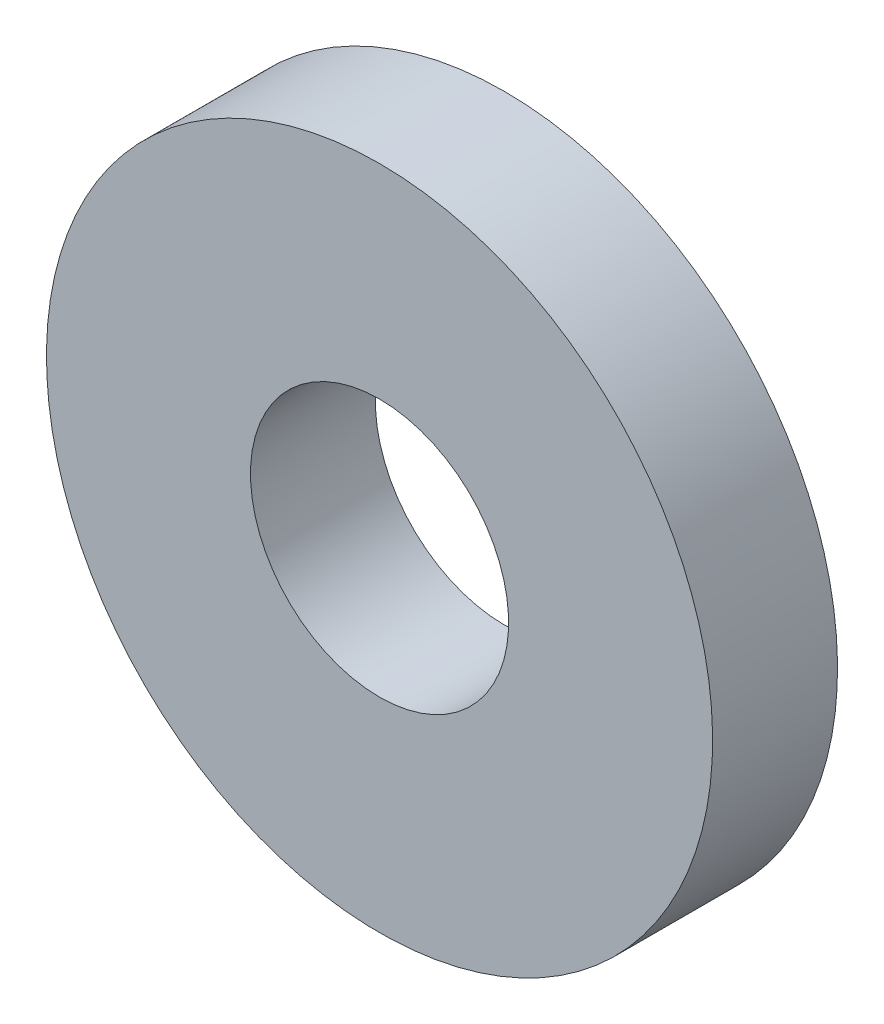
ISO-10303-21;
HEADER;
FILE_DESCRIPTION(('STEP AP214'),'2;1');
FILE_NAME('part.step','',(''),(''),'','','');
FILE_SCHEMA(('AUTOMOTIVE_DESIGN { 1 0 10303 214 1 1 1 1 }'));
ENDSEC;
DATA;
#1=APPLICATION_CONTEXT('core data for automotive mechanical design processes');
#2=APPLICATION_PROTOCOL_DEFINITION('international standard','automotive_design',2000,#1);
#3=PRODUCT_CONTEXT('',#1,'mechanical');
#4=PRODUCT('Part','Part','',(#3));
#5=PRODUCT_RELATED_PRODUCT_CATEGORY('part','',(#4));
#6=PRODUCT_DEFINITION_FORMATION('','',#4);
#7=PRODUCT_DEFINITION_CONTEXT('part definition',#1,'design');
#8=PRODUCT_DEFINITION('design','',#6,#7);
#9=PRODUCT_DEFINITION_SHAPE('','',#8);
#10=(LENGTH_UNIT() NAMED_UNIT(*) SI_UNIT(.MILLI.,.METRE.));
#11=(NAMED_UNIT(*) PLANE_ANGLE_UNIT() SI_UNIT($,.RADIAN.));
#12=(NAMED_UNIT(*) SI_UNIT($,.STERADIAN.) SOLID_ANGLE_UNIT());
#13=UNCERTAINTY_MEASURE_WITH_UNIT(LENGTH_MEASURE(1.E-05),#10,'distance_accuracy_value','');
#14=(GEOMETRIC_REPRESENTATION_CONTEXT(3) GLOBAL_UNCERTAINTY_ASSIGNED_CONTEXT((#13)) GLOBAL_UNIT_ASSIGNED_CONTEXT((#10,
#11,#12)) REPRESENTATION_CONTEXT('',''));
#15=CARTESIAN_POINT('',(0.,0.,0.));
#16=DIRECTION('',(0.,0.,1.));
#17=DIRECTION('',(1.,0.,0.));
#18=AXIS2_PLACEMENT_3D('',#15,#16,#17);
#19=CARTESIAN_POINT('',(0.,0.,0.));
#20=DIRECTION('',(0.,0.,-1.));
#21=DIRECTION('',(0.,1.,0.));
#22=AXIS2_PLACEMENT_3D('',#19,#20,#21);
#23=PLANE('',#22);
#24=CARTESIAN_POINT('',(0.,0.,0.));
#25=DIRECTION('',(0.,0.,-1.));
#26=DIRECTION('',(0.,1.,0.));
#27=AXIS2_PLACEMENT_3D('',#24,#25,#26);
#28=CIRCLE('',#27,8.);
#29=CARTESIAN_POINT('',(0.,8.,0.));
#30=VERTEX_POINT('',#29);
#31=EDGE_CURVE('E8',#30,#30,#28,.T.);
#32=ORIENTED_EDGE('',*,*,#31,.T.);
#33=EDGE_LOOP('',(#32));
#34=FACE_BOUND('',#33,.T.);
#35=CARTESIAN_POINT('',(0.,0.,0.));
#36=DIRECTION('',(0.,0.,-1.));
#37=DIRECTION('',(0.,1.,0.));
#38=AXIS2_PLACEMENT_3D('',#35,#36,#37);
#39=CIRCLE('',#38,3.1);
#40=CARTESIAN_POINT('',(0.,3.1,0.));
#41=VERTEX_POINT('',#40);
#42=EDGE_CURVE('E23',#41,#41,#39,.T.);
#43=ORIENTED_EDGE('',*,*,#42,.F.);
#44=EDGE_LOOP('',(#43));
#45=FACE_BOUND('',#44,.T.);
#46=ADVANCED_FACE('F12',(#34,#45),#23,.T.);
#47=CARTESIAN_POINT('',(0.,0.,3.));
#48=DIRECTION('',(0.,0.,-1.));
#49=DIRECTION('',(0.,1.,0.));
#50=AXIS2_PLACEMENT_3D('',#47,#48,#49);
#51=PLANE('',#50);
#52=CARTESIAN_POINT('',(0.,0.,3.));
#53=DIRECTION('',(0.,0.,-1.));
#54=DIRECTION('',(0.,1.,0.));
#55=AXIS2_PLACEMENT_3D('',#52,#53,#54);
#56=CIRCLE('',#55,8.);
#57=CARTESIAN_POINT('',(0.,8.,3.));
#58=VERTEX_POINT('',#57);
#59=EDGE_CURVE('E19',#58,#58,#56,.T.);
#60=ORIENTED_EDGE('',*,*,#59,.F.);
#61=EDGE_LOOP('',(#60));
#62=FACE_BOUND('',#61,.T.);
#63=CARTESIAN_POINT('',(0.,0.,3.));
#64=DIRECTION('',(0.,0.,-1.));
#65=DIRECTION('',(0.,1.,0.));
#66=AXIS2_PLACEMENT_3D('',#63,#64,#65);
#67=CIRCLE('',#66,3.1);
#68=CARTESIAN_POINT('',(0.,3.1,3.));
#69=VERTEX_POINT('',#68);
#70=EDGE_CURVE('E27',#69,#69,#67,.T.);
#71=ORIENTED_EDGE('',*,*,#70,.T.);
#72=EDGE_LOOP('',(#71));
#73=FACE_BOUND('',#72,.T.);
#74=ADVANCED_FACE('F33',(#62,#73),#51,.F.);
#75=CARTESIAN_POINT('',(0.,0.,0.));
#76=DIRECTION('',(0.,0.,1.));
#77=DIRECTION('',(0.,-1.,0.));
#78=AXIS2_PLACEMENT_3D('',#75,#76,#77);
#79=CYLINDRICAL_SURFACE('',#78,8.);
#80=ORIENTED_EDGE('',*,*,#31,.F.);
#81=EDGE_LOOP('',(#80));
#82=FACE_BOUND('',#81,.T.);
#83=ORIENTED_EDGE('',*,*,#59,.T.);
#84=EDGE_LOOP('',(#83));
#85=FACE_BOUND('',#84,.T.);
#86=ADVANCED_FACE('F14',(#82,#85),#79,.T.);
#87=CARTESIAN_POINT('',(0.,0.,0.));
#88=DIRECTION('',(0.,0.,1.));
#89=DIRECTION('',(0.,-1.,0.));
#90=AXIS2_PLACEMENT_3D('',#87,#88,#89);
#91=CYLINDRICAL_SURFACE('',#90,3.1);
#92=ORIENTED_EDGE('',*,*,#42,.T.);
#93=EDGE_LOOP('',(#92));
#94=FACE_BOUND('',#93,.T.);
#95=ORIENTED_EDGE('',*,*,#70,.F.);
#96=EDGE_LOOP('',(#95));
#97=FACE_BOUND('',#96,.T.);
#98=ADVANCED_FACE('F35',(#94,#97),#91,.F.);
#99=CLOSED_SHELL('',(#46,#74,#86,#98));
#100=MANIFOLD_SOLID_BREP('B1',#99);
#101=ADVANCED_BREP_SHAPE_REPRESENTATION('',(#18,#100),#14);
#102=SHAPE_DEFINITION_REPRESENTATION(#9,#101);
ENDSEC;
END-ISO-10303-21;
